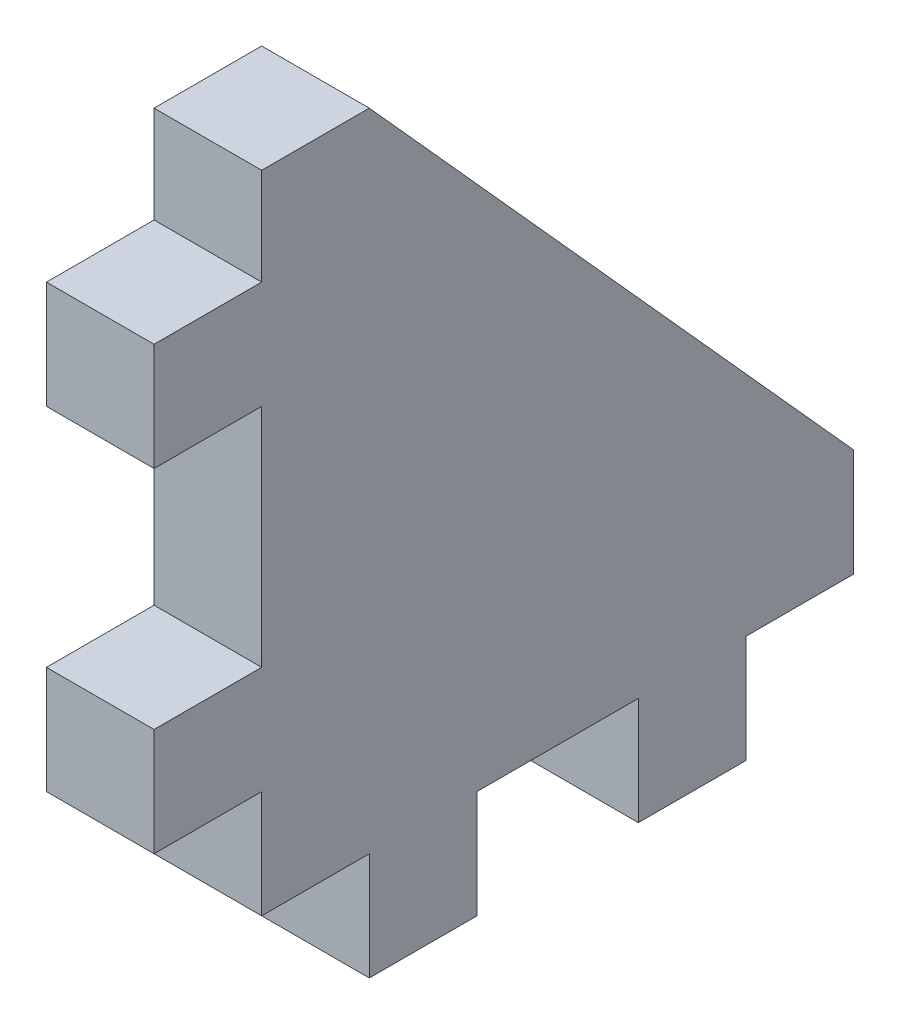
ISO-10303-21;
HEADER;
FILE_DESCRIPTION(('STEP AP214'),'2;1');
FILE_NAME('part.step','',(''),(''),'','','');
FILE_SCHEMA(('AUTOMOTIVE_DESIGN { 1 0 10303 214 1 1 1 1 }'));
ENDSEC;
DATA;
#1=APPLICATION_CONTEXT('core data for automotive mechanical design processes');
#2=APPLICATION_PROTOCOL_DEFINITION('international standard','automotive_design',2000,#1);
#3=PRODUCT_CONTEXT('',#1,'mechanical');
#4=PRODUCT('Part','Part','',(#3));
#5=PRODUCT_RELATED_PRODUCT_CATEGORY('part','',(#4));
#6=PRODUCT_DEFINITION_FORMATION('','',#4);
#7=PRODUCT_DEFINITION_CONTEXT('part definition',#1,'design');
#8=PRODUCT_DEFINITION('design','',#6,#7);
#9=PRODUCT_DEFINITION_SHAPE('','',#8);
#10=(LENGTH_UNIT() NAMED_UNIT(*) SI_UNIT(.MILLI.,.METRE.));
#11=(NAMED_UNIT(*) PLANE_ANGLE_UNIT() SI_UNIT($,.RADIAN.));
#12=(NAMED_UNIT(*) SI_UNIT($,.STERADIAN.) SOLID_ANGLE_UNIT());
#13=UNCERTAINTY_MEASURE_WITH_UNIT(LENGTH_MEASURE(1.E-05),#10,'distance_accuracy_value','');
#14=(GEOMETRIC_REPRESENTATION_CONTEXT(3) GLOBAL_UNCERTAINTY_ASSIGNED_CONTEXT((#13)) GLOBAL_UNIT_ASSIGNED_CONTEXT((#10,
#11,#12)) REPRESENTATION_CONTEXT('',''));
#15=CARTESIAN_POINT('',(0.,0.,0.));
#16=DIRECTION('',(0.,0.,1.));
#17=DIRECTION('',(1.,0.,0.));
#18=AXIS2_PLACEMENT_3D('',#15,#16,#17);
#19=CARTESIAN_POINT('',(20.,40.,20.));
#20=DIRECTION('',(0.,-1.,0.));
#21=DIRECTION('',(0.,0.,-1.));
#22=AXIS2_PLACEMENT_3D('',#19,#20,#21);
#23=PLANE('',#22);
#24=DIRECTION('',(0.,0.,1.));
#25=VECTOR('',#24,1.);
#26=CARTESIAN_POINT('',(0.,40.,20.));
#27=LINE('',#26,#25);
#28=CARTESIAN_POINT('',(0.,40.,0.));
#29=VERTEX_POINT('',#28);
#30=CARTESIAN_POINT('',(0.,40.,20.));
#31=VERTEX_POINT('',#30);
#32=EDGE_CURVE('E206',#29,#31,#27,.T.);
#33=ORIENTED_EDGE('',*,*,#32,.T.);
#34=DIRECTION('',(-1.,0.,0.));
#35=VECTOR('',#34,1.);
#36=CARTESIAN_POINT('',(20.,40.,20.));
#37=LINE('',#36,#35);
#38=CARTESIAN_POINT('',(20.,40.,20.));
#39=VERTEX_POINT('',#38);
#40=EDGE_CURVE('E11',#39,#31,#37,.T.);
#41=ORIENTED_EDGE('',*,*,#40,.F.);
#42=DIRECTION('',(0.,0.,1.));
#43=VECTOR('',#42,1.);
#44=CARTESIAN_POINT('',(20.,40.,20.));
#45=LINE('',#44,#43);
#46=CARTESIAN_POINT('',(20.,40.,0.));
#47=VERTEX_POINT('',#46);
#48=EDGE_CURVE('E246',#47,#39,#45,.T.);
#49=ORIENTED_EDGE('',*,*,#48,.F.);
#50=DIRECTION('',(-1.,0.,0.));
#51=VECTOR('',#50,1.);
#52=CARTESIAN_POINT('',(20.,40.,0.));
#53=LINE('',#52,#51);
#54=EDGE_CURVE('E202',#47,#29,#53,.T.);
#55=ORIENTED_EDGE('',*,*,#54,.T.);
#56=EDGE_LOOP('',(#33,#41,#49,#55));
#57=FACE_BOUND('',#56,.T.);
#58=ADVANCED_FACE('F32',(#57),#23,.F.);
#59=CARTESIAN_POINT('',(20.,20.,20.));
#60=DIRECTION('',(0.,0.,-1.));
#61=DIRECTION('',(-1.,0.,0.));
#62=AXIS2_PLACEMENT_3D('',#59,#60,#61);
#63=PLANE('',#62);
#64=DIRECTION('',(0.,-1.,0.));
#65=VECTOR('',#64,1.);
#66=CARTESIAN_POINT('',(0.,20.,20.));
#67=LINE('',#66,#65);
#68=CARTESIAN_POINT('',(0.,20.,20.));
#69=VERTEX_POINT('',#68);
#70=EDGE_CURVE('E209',#31,#69,#67,.T.);
#71=ORIENTED_EDGE('',*,*,#70,.T.);
#72=DIRECTION('',(-1.,0.,0.));
#73=VECTOR('',#72,1.);
#74=CARTESIAN_POINT('',(20.,20.,20.));
#75=LINE('',#74,#73);
#76=CARTESIAN_POINT('',(20.,20.,20.));
#77=VERTEX_POINT('',#76);
#78=EDGE_CURVE('E40',#77,#69,#75,.T.);
#79=ORIENTED_EDGE('',*,*,#78,.F.);
#80=DIRECTION('',(0.,-1.,0.));
#81=VECTOR('',#80,1.);
#82=CARTESIAN_POINT('',(20.,20.,20.));
#83=LINE('',#82,#81);
#84=EDGE_CURVE('E130',#39,#77,#83,.T.);
#85=ORIENTED_EDGE('',*,*,#84,.F.);
#86=ORIENTED_EDGE('',*,*,#40,.T.);
#87=EDGE_LOOP('',(#71,#79,#85,#86));
#88=FACE_BOUND('',#87,.T.);
#89=ADVANCED_FACE('F369',(#88),#63,.F.);
#90=CARTESIAN_POINT('',(20.,20.,0.));
#91=DIRECTION('',(0.,1.,0.));
#92=DIRECTION('',(0.,0.,1.));
#93=AXIS2_PLACEMENT_3D('',#90,#91,#92);
#94=PLANE('',#93);
#95=DIRECTION('',(0.,0.,-1.));
#96=VECTOR('',#95,1.);
#97=CARTESIAN_POINT('',(0.,20.,0.));
#98=LINE('',#97,#96);
#99=CARTESIAN_POINT('',(0.,20.,0.));
#100=VERTEX_POINT('',#99);
#101=EDGE_CURVE('E211',#69,#100,#98,.T.);
#102=ORIENTED_EDGE('',*,*,#101,.T.);
#103=DIRECTION('',(-1.,0.,0.));
#104=VECTOR('',#103,1.);
#105=CARTESIAN_POINT('',(20.,20.,0.));
#106=LINE('',#105,#104);
#107=CARTESIAN_POINT('',(20.,20.,0.));
#108=VERTEX_POINT('',#107);
#109=EDGE_CURVE('E292',#108,#100,#106,.T.);
#110=ORIENTED_EDGE('',*,*,#109,.F.);
#111=DIRECTION('',(0.,0.,-1.));
#112=VECTOR('',#111,1.);
#113=CARTESIAN_POINT('',(20.,20.,0.));
#114=LINE('',#113,#112);
#115=EDGE_CURVE('E300',#77,#108,#114,.T.);
#116=ORIENTED_EDGE('',*,*,#115,.F.);
#117=ORIENTED_EDGE('',*,*,#78,.T.);
#118=EDGE_LOOP('',(#102,#110,#116,#117));
#119=FACE_BOUND('',#118,.T.);
#120=ADVANCED_FACE('F298',(#119),#94,.F.);
#121=CARTESIAN_POINT('',(20.,0.,0.));
#122=DIRECTION('',(0.,0.,-1.));
#123=DIRECTION('',(-1.,0.,0.));
#124=AXIS2_PLACEMENT_3D('',#121,#122,#123);
#125=PLANE('',#124);
#126=DIRECTION('',(0.,-1.,0.));
#127=VECTOR('',#126,1.);
#128=CARTESIAN_POINT('',(0.,0.,0.));
#129=LINE('',#128,#127);
#130=CARTESIAN_POINT('',(0.,0.,0.));
#131=VERTEX_POINT('',#130);
#132=EDGE_CURVE('E213',#100,#131,#129,.T.);
#133=ORIENTED_EDGE('',*,*,#132,.T.);
#134=DIRECTION('',(-1.,0.,0.));
#135=VECTOR('',#134,1.);
#136=CARTESIAN_POINT('',(20.,0.,0.));
#137=LINE('',#136,#135);
#138=CARTESIAN_POINT('',(20.,0.,0.));
#139=VERTEX_POINT('',#138);
#140=EDGE_CURVE('E289',#139,#131,#137,.T.);
#141=ORIENTED_EDGE('',*,*,#140,.F.);
#142=DIRECTION('',(0.,-1.,0.));
#143=VECTOR('',#142,1.);
#144=CARTESIAN_POINT('',(20.,0.,0.));
#145=LINE('',#144,#143);
#146=EDGE_CURVE('E318',#108,#139,#145,.T.);
#147=ORIENTED_EDGE('',*,*,#146,.F.);
#148=ORIENTED_EDGE('',*,*,#109,.T.);
#149=EDGE_LOOP('',(#133,#141,#147,#148));
#150=FACE_BOUND('',#149,.T.);
#151=ADVANCED_FACE('F309',(#150),#125,.F.);
#152=CARTESIAN_POINT('',(20.,0.,0.));
#153=DIRECTION('',(0.,1.,0.));
#154=DIRECTION('',(0.,0.,1.));
#155=AXIS2_PLACEMENT_3D('',#152,#153,#154);
#156=PLANE('',#155);
#157=DIRECTION('',(0.,0.,-1.));
#158=VECTOR('',#157,1.);
#159=CARTESIAN_POINT('',(0.,0.,0.));
#160=LINE('',#159,#158);
#161=CARTESIAN_POINT('',(0.,0.,-20.));
#162=VERTEX_POINT('',#161);
#163=EDGE_CURVE('E215',#131,#162,#160,.T.);
#164=ORIENTED_EDGE('',*,*,#163,.T.);
#165=DIRECTION('',(-1.,0.,0.));
#166=VECTOR('',#165,1.);
#167=CARTESIAN_POINT('',(20.,0.,-20.));
#168=LINE('',#167,#166);
#169=CARTESIAN_POINT('',(20.,0.,-20.));
#170=VERTEX_POINT('',#169);
#171=EDGE_CURVE('E286',#170,#162,#168,.T.);
#172=ORIENTED_EDGE('',*,*,#171,.F.);
#173=DIRECTION('',(0.,0.,-1.));
#174=VECTOR('',#173,1.);
#175=CARTESIAN_POINT('',(20.,0.,0.));
#176=LINE('',#175,#174);
#177=EDGE_CURVE('E315',#139,#170,#176,.T.);
#178=ORIENTED_EDGE('',*,*,#177,.F.);
#179=ORIENTED_EDGE('',*,*,#140,.T.);
#180=EDGE_LOOP('',(#164,#172,#178,#179));
#181=FACE_BOUND('',#180,.T.);
#182=ADVANCED_FACE('F313',(#181),#156,.F.);
#183=CARTESIAN_POINT('',(20.,0.,-20.));
#184=DIRECTION('',(0.,0.,-1.));
#185=DIRECTION('',(-1.,0.,0.));
#186=AXIS2_PLACEMENT_3D('',#183,#184,#185);
#187=PLANE('',#186);
#188=DIRECTION('',(0.,-1.,0.));
#189=VECTOR('',#188,1.);
#190=CARTESIAN_POINT('',(0.,0.,-20.));
#191=LINE('',#190,#189);
#192=CARTESIAN_POINT('',(0.,-20.,-20.));
#193=VERTEX_POINT('',#192);
#194=EDGE_CURVE('E217',#162,#193,#191,.T.);
#195=ORIENTED_EDGE('',*,*,#194,.T.);
#196=DIRECTION('',(-1.,0.,0.));
#197=VECTOR('',#196,1.);
#198=CARTESIAN_POINT('',(20.,-20.,-20.));
#199=LINE('',#198,#197);
#200=CARTESIAN_POINT('',(20.,-20.,-20.));
#201=VERTEX_POINT('',#200);
#202=EDGE_CURVE('E283',#201,#193,#199,.T.);
#203=ORIENTED_EDGE('',*,*,#202,.F.);
#204=DIRECTION('',(0.,-1.,0.));
#205=VECTOR('',#204,1.);
#206=CARTESIAN_POINT('',(20.,0.,-20.));
#207=LINE('',#206,#205);
#208=EDGE_CURVE('E317',#170,#201,#207,.T.);
#209=ORIENTED_EDGE('',*,*,#208,.F.);
#210=ORIENTED_EDGE('',*,*,#171,.T.);
#211=EDGE_LOOP('',(#195,#203,#209,#210));
#212=FACE_BOUND('',#211,.T.);
#213=ADVANCED_FACE('F382',(#212),#187,.F.);
#214=CARTESIAN_POINT('',(20.,-20.,-20.));
#215=DIRECTION('',(0.,1.,0.));
#216=DIRECTION('',(0.,0.,1.));
#217=AXIS2_PLACEMENT_3D('',#214,#215,#216);
#218=PLANE('',#217);
#219=DIRECTION('',(0.,0.,-1.));
#220=VECTOR('',#219,1.);
#221=CARTESIAN_POINT('',(0.,-20.,-20.));
#222=LINE('',#221,#220);
#223=CARTESIAN_POINT('',(0.,-20.,-40.));
#224=VERTEX_POINT('',#223);
#225=EDGE_CURVE('E219',#193,#224,#222,.T.);
#226=ORIENTED_EDGE('',*,*,#225,.T.);
#227=DIRECTION('',(-1.,0.,0.));
#228=VECTOR('',#227,1.);
#229=CARTESIAN_POINT('',(20.,-20.,-40.));
#230=LINE('',#229,#228);
#231=CARTESIAN_POINT('',(20.,-20.,-40.));
#232=VERTEX_POINT('',#231);
#233=EDGE_CURVE('E280',#232,#224,#230,.T.);
#234=ORIENTED_EDGE('',*,*,#233,.F.);
#235=DIRECTION('',(0.,0.,-1.));
#236=VECTOR('',#235,1.);
#237=CARTESIAN_POINT('',(20.,-20.,-20.));
#238=LINE('',#237,#236);
#239=EDGE_CURVE('E320',#201,#232,#238,.T.);
#240=ORIENTED_EDGE('',*,*,#239,.F.);
#241=ORIENTED_EDGE('',*,*,#202,.T.);
#242=EDGE_LOOP('',(#226,#234,#240,#241));
#243=FACE_BOUND('',#242,.T.);
#244=ADVANCED_FACE('F385',(#243),#218,.F.);
#245=CARTESIAN_POINT('',(20.,-20.,-40.));
#246=DIRECTION('',(0.,0.,1.));
#247=DIRECTION('',(1.,0.,0.));
#248=AXIS2_PLACEMENT_3D('',#245,#246,#247);
#249=PLANE('',#248);
#250=DIRECTION('',(0.,1.,0.));
#251=VECTOR('',#250,1.);
#252=CARTESIAN_POINT('',(0.,-20.,-40.));
#253=LINE('',#252,#251);
#254=CARTESIAN_POINT('',(0.,0.,-40.));
#255=VERTEX_POINT('',#254);
#256=EDGE_CURVE('E221',#224,#255,#253,.T.);
#257=ORIENTED_EDGE('',*,*,#256,.T.);
#258=DIRECTION('',(-1.,0.,0.));
#259=VECTOR('',#258,1.);
#260=CARTESIAN_POINT('',(20.,0.,-40.));
#261=LINE('',#260,#259);
#262=CARTESIAN_POINT('',(20.,0.,-40.));
#263=VERTEX_POINT('',#262);
#264=EDGE_CURVE('E277',#263,#255,#261,.T.);
#265=ORIENTED_EDGE('',*,*,#264,.F.);
#266=DIRECTION('',(0.,1.,0.));
#267=VECTOR('',#266,1.);
#268=CARTESIAN_POINT('',(20.,-20.,-40.));
#269=LINE('',#268,#267);
#270=EDGE_CURVE('E326',#232,#263,#269,.T.);
#271=ORIENTED_EDGE('',*,*,#270,.F.);
#272=ORIENTED_EDGE('',*,*,#233,.T.);
#273=EDGE_LOOP('',(#257,#265,#271,#272));
#274=FACE_BOUND('',#273,.T.);
#275=ADVANCED_FACE('F389',(#274),#249,.F.);
#276=CARTESIAN_POINT('',(20.,0.,-40.));
#277=DIRECTION('',(0.,1.,0.));
#278=DIRECTION('',(0.,0.,1.));
#279=AXIS2_PLACEMENT_3D('',#276,#277,#278);
#280=PLANE('',#279);
#281=DIRECTION('',(0.,0.,-1.));
#282=VECTOR('',#281,1.);
#283=CARTESIAN_POINT('',(0.,0.,-40.));
#284=LINE('',#283,#282);
#285=CARTESIAN_POINT('',(0.,0.,-70.));
#286=VERTEX_POINT('',#285);
#287=EDGE_CURVE('E223',#255,#286,#284,.T.);
#288=ORIENTED_EDGE('',*,*,#287,.T.);
#289=DIRECTION('',(-1.,0.,0.));
#290=VECTOR('',#289,1.);
#291=CARTESIAN_POINT('',(20.,0.,-70.));
#292=LINE('',#291,#290);
#293=CARTESIAN_POINT('',(20.,0.,-70.));
#294=VERTEX_POINT('',#293);
#295=EDGE_CURVE('E274',#294,#286,#292,.T.);
#296=ORIENTED_EDGE('',*,*,#295,.F.);
#297=DIRECTION('',(0.,0.,-1.));
#298=VECTOR('',#297,1.);
#299=CARTESIAN_POINT('',(20.,0.,-40.));
#300=LINE('',#299,#298);
#301=EDGE_CURVE('E328',#263,#294,#300,.T.);
#302=ORIENTED_EDGE('',*,*,#301,.F.);
#303=ORIENTED_EDGE('',*,*,#264,.T.);
#304=EDGE_LOOP('',(#288,#296,#302,#303));
#305=FACE_BOUND('',#304,.T.);
#306=ADVANCED_FACE('F393',(#305),#280,.F.);
#307=CARTESIAN_POINT('',(20.,-20.,-70.));
#308=DIRECTION('',(0.,0.,-1.));
#309=DIRECTION('',(-1.,0.,0.));
#310=AXIS2_PLACEMENT_3D('',#307,#308,#309);
#311=PLANE('',#310);
#312=DIRECTION('',(0.,-1.,0.));
#313=VECTOR('',#312,1.);
#314=CARTESIAN_POINT('',(0.,-20.,-70.));
#315=LINE('',#314,#313);
#316=CARTESIAN_POINT('',(0.,-20.,-70.));
#317=VERTEX_POINT('',#316);
#318=EDGE_CURVE('E225',#286,#317,#315,.T.);
#319=ORIENTED_EDGE('',*,*,#318,.T.);
#320=DIRECTION('',(-1.,0.,0.));
#321=VECTOR('',#320,1.);
#322=CARTESIAN_POINT('',(20.,-20.,-70.));
#323=LINE('',#322,#321);
#324=CARTESIAN_POINT('',(20.,-20.,-70.));
#325=VERTEX_POINT('',#324);
#326=EDGE_CURVE('E271',#325,#317,#323,.T.);
#327=ORIENTED_EDGE('',*,*,#326,.F.);
#328=DIRECTION('',(0.,-1.,0.));
#329=VECTOR('',#328,1.);
#330=CARTESIAN_POINT('',(20.,-20.,-70.));
#331=LINE('',#330,#329);
#332=EDGE_CURVE('E330',#294,#325,#331,.T.);
#333=ORIENTED_EDGE('',*,*,#332,.F.);
#334=ORIENTED_EDGE('',*,*,#295,.T.);
#335=EDGE_LOOP('',(#319,#327,#333,#334));
#336=FACE_BOUND('',#335,.T.);
#337=ADVANCED_FACE('F397',(#336),#311,.F.);
#338=CARTESIAN_POINT('',(20.,-20.,-90.));
#339=DIRECTION('',(0.,1.,0.));
#340=DIRECTION('',(0.,0.,1.));
#341=AXIS2_PLACEMENT_3D('',#338,#339,#340);
#342=PLANE('',#341);
#343=DIRECTION('',(0.,0.,-1.));
#344=VECTOR('',#343,1.);
#345=CARTESIAN_POINT('',(0.,-20.,-90.));
#346=LINE('',#345,#344);
#347=CARTESIAN_POINT('',(0.,-20.,-90.));
#348=VERTEX_POINT('',#347);
#349=EDGE_CURVE('E227',#317,#348,#346,.T.);
#350=ORIENTED_EDGE('',*,*,#349,.T.);
#351=DIRECTION('',(-1.,0.,0.));
#352=VECTOR('',#351,1.);
#353=CARTESIAN_POINT('',(20.,-20.,-90.));
#354=LINE('',#353,#352);
#355=CARTESIAN_POINT('',(20.,-20.,-90.));
#356=VERTEX_POINT('',#355);
#357=EDGE_CURVE('E268',#356,#348,#354,.T.);
#358=ORIENTED_EDGE('',*,*,#357,.F.);
#359=DIRECTION('',(0.,0.,-1.));
#360=VECTOR('',#359,1.);
#361=CARTESIAN_POINT('',(20.,-20.,-90.));
#362=LINE('',#361,#360);
#363=EDGE_CURVE('E332',#325,#356,#362,.T.);
#364=ORIENTED_EDGE('',*,*,#363,.F.);
#365=ORIENTED_EDGE('',*,*,#326,.T.);
#366=EDGE_LOOP('',(#350,#358,#364,#365));
#367=FACE_BOUND('',#366,.T.);
#368=ADVANCED_FACE('F401',(#367),#342,.F.);
#369=CARTESIAN_POINT('',(20.,0.,-90.));
#370=DIRECTION('',(0.,0.,1.));
#371=DIRECTION('',(1.,0.,0.));
#372=AXIS2_PLACEMENT_3D('',#369,#370,#371);
#373=PLANE('',#372);
#374=DIRECTION('',(0.,1.,0.));
#375=VECTOR('',#374,1.);
#376=CARTESIAN_POINT('',(0.,0.,-90.));
#377=LINE('',#376,#375);
#378=CARTESIAN_POINT('',(0.,0.,-90.));
#379=VERTEX_POINT('',#378);
#380=EDGE_CURVE('E229',#348,#379,#377,.T.);
#381=ORIENTED_EDGE('',*,*,#380,.T.);
#382=DIRECTION('',(-1.,0.,0.));
#383=VECTOR('',#382,1.);
#384=CARTESIAN_POINT('',(20.,0.,-90.));
#385=LINE('',#384,#383);
#386=CARTESIAN_POINT('',(20.,0.,-90.));
#387=VERTEX_POINT('',#386);
#388=EDGE_CURVE('E265',#387,#379,#385,.T.);
#389=ORIENTED_EDGE('',*,*,#388,.F.);
#390=DIRECTION('',(0.,1.,0.));
#391=VECTOR('',#390,1.);
#392=CARTESIAN_POINT('',(20.,0.,-90.));
#393=LINE('',#392,#391);
#394=EDGE_CURVE('E334',#356,#387,#393,.T.);
#395=ORIENTED_EDGE('',*,*,#394,.F.);
#396=ORIENTED_EDGE('',*,*,#357,.T.);
#397=EDGE_LOOP('',(#381,#389,#395,#396));
#398=FACE_BOUND('',#397,.T.);
#399=ADVANCED_FACE('F405',(#398),#373,.F.);
#400=CARTESIAN_POINT('',(20.,0.,-90.));
#401=DIRECTION('',(0.,1.,0.));
#402=DIRECTION('',(0.,0.,1.));
#403=AXIS2_PLACEMENT_3D('',#400,#401,#402);
#404=PLANE('',#403);
#405=DIRECTION('',(0.,0.,-1.));
#406=VECTOR('',#405,1.);
#407=CARTESIAN_POINT('',(0.,0.,-90.));
#408=LINE('',#407,#406);
#409=CARTESIAN_POINT('',(0.,0.,-110.));
#410=VERTEX_POINT('',#409);
#411=EDGE_CURVE('E231',#379,#410,#408,.T.);
#412=ORIENTED_EDGE('',*,*,#411,.T.);
#413=DIRECTION('',(-1.,0.,0.));
#414=VECTOR('',#413,1.);
#415=CARTESIAN_POINT('',(20.,0.,-110.));
#416=LINE('',#415,#414);
#417=CARTESIAN_POINT('',(20.,0.,-110.));
#418=VERTEX_POINT('',#417);
#419=EDGE_CURVE('E262',#418,#410,#416,.T.);
#420=ORIENTED_EDGE('',*,*,#419,.F.);
#421=DIRECTION('',(0.,0.,-1.));
#422=VECTOR('',#421,1.);
#423=CARTESIAN_POINT('',(20.,0.,-90.));
#424=LINE('',#423,#422);
#425=EDGE_CURVE('E336',#387,#418,#424,.T.);
#426=ORIENTED_EDGE('',*,*,#425,.F.);
#427=ORIENTED_EDGE('',*,*,#388,.T.);
#428=EDGE_LOOP('',(#412,#420,#426,#427));
#429=FACE_BOUND('',#428,.T.);
#430=ADVANCED_FACE('F409',(#429),#404,.F.);
#431=CARTESIAN_POINT('',(20.,0.,-110.));
#432=DIRECTION('',(0.,0.,1.));
#433=DIRECTION('',(1.,0.,0.));
#434=AXIS2_PLACEMENT_3D('',#431,#432,#433);
#435=PLANE('',#434);
#436=DIRECTION('',(0.,1.,0.));
#437=VECTOR('',#436,1.);
#438=CARTESIAN_POINT('',(0.,0.,-110.));
#439=LINE('',#438,#437);
#440=CARTESIAN_POINT('',(0.,20.,-110.));
#441=VERTEX_POINT('',#440);
#442=EDGE_CURVE('E233',#410,#441,#439,.T.);
#443=ORIENTED_EDGE('',*,*,#442,.T.);
#444=DIRECTION('',(-1.,0.,0.));
#445=VECTOR('',#444,1.);
#446=CARTESIAN_POINT('',(20.,20.,-110.));
#447=LINE('',#446,#445);
#448=CARTESIAN_POINT('',(20.,20.,-110.));
#449=VERTEX_POINT('',#448);
#450=EDGE_CURVE('E259',#449,#441,#447,.T.);
#451=ORIENTED_EDGE('',*,*,#450,.F.);
#452=DIRECTION('',(0.,1.,0.));
#453=VECTOR('',#452,1.);
#454=CARTESIAN_POINT('',(20.,0.,-110.));
#455=LINE('',#454,#453);
#456=EDGE_CURVE('E338',#418,#449,#455,.T.);
#457=ORIENTED_EDGE('',*,*,#456,.F.);
#458=ORIENTED_EDGE('',*,*,#419,.T.);
#459=EDGE_LOOP('',(#443,#451,#457,#458));
#460=FACE_BOUND('',#459,.T.);
#461=ADVANCED_FACE('F413',(#460),#435,.F.);
#462=CARTESIAN_POINT('',(20.,20.,-110.));
#463=DIRECTION('',(0.,-0.66896473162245,0.743294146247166));
#464=DIRECTION('',(0.,-0.743294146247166,-0.66896473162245));
#465=AXIS2_PLACEMENT_3D('',#462,#463,#464);
#466=PLANE('',#465);
#467=DIRECTION('',(0.,0.743294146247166,0.66896473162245));
#468=VECTOR('',#467,1.);
#469=CARTESIAN_POINT('',(0.,20.,-110.));
#470=LINE('',#469,#468);
#471=CARTESIAN_POINT('',(0.,120.,-20.));
#472=VERTEX_POINT('',#471);
#473=EDGE_CURVE('E235',#441,#472,#470,.T.);
#474=ORIENTED_EDGE('',*,*,#473,.T.);
#475=DIRECTION('',(-1.,0.,0.));
#476=VECTOR('',#475,1.);
#477=CARTESIAN_POINT('',(20.,120.,-20.));
#478=LINE('',#477,#476);
#479=CARTESIAN_POINT('',(20.,120.,-20.));
#480=VERTEX_POINT('',#479);
#481=EDGE_CURVE('E256',#480,#472,#478,.T.);
#482=ORIENTED_EDGE('',*,*,#481,.F.);
#483=DIRECTION('',(0.,0.743294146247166,0.66896473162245));
#484=VECTOR('',#483,1.);
#485=CARTESIAN_POINT('',(20.,20.,-110.));
#486=LINE('',#485,#484);
#487=EDGE_CURVE('E340',#449,#480,#486,.T.);
#488=ORIENTED_EDGE('',*,*,#487,.F.);
#489=ORIENTED_EDGE('',*,*,#450,.T.);
#490=EDGE_LOOP('',(#474,#482,#488,#489));
#491=FACE_BOUND('',#490,.T.);
#492=ADVANCED_FACE('F417',(#491),#466,.F.);
#493=CARTESIAN_POINT('',(20.,120.,0.));
#494=DIRECTION('',(0.,-1.,0.));
#495=DIRECTION('',(0.,0.,-1.));
#496=AXIS2_PLACEMENT_3D('',#493,#494,#495);
#497=PLANE('',#496);
#498=DIRECTION('',(0.,0.,1.));
#499=VECTOR('',#498,1.);
#500=CARTESIAN_POINT('',(0.,120.,0.));
#501=LINE('',#500,#499);
#502=CARTESIAN_POINT('',(0.,120.,0.));
#503=VERTEX_POINT('',#502);
#504=EDGE_CURVE('E237',#472,#503,#501,.T.);
#505=ORIENTED_EDGE('',*,*,#504,.T.);
#506=DIRECTION('',(-1.,0.,0.));
#507=VECTOR('',#506,1.);
#508=CARTESIAN_POINT('',(20.,120.,0.));
#509=LINE('',#508,#507);
#510=CARTESIAN_POINT('',(20.,120.,0.));
#511=VERTEX_POINT('',#510);
#512=EDGE_CURVE('E253',#511,#503,#509,.T.);
#513=ORIENTED_EDGE('',*,*,#512,.F.);
#514=DIRECTION('',(0.,0.,1.));
#515=VECTOR('',#514,1.);
#516=CARTESIAN_POINT('',(20.,120.,0.));
#517=LINE('',#516,#515);
#518=EDGE_CURVE('E342',#480,#511,#517,.T.);
#519=ORIENTED_EDGE('',*,*,#518,.F.);
#520=ORIENTED_EDGE('',*,*,#481,.T.);
#521=EDGE_LOOP('',(#505,#513,#519,#520));
#522=FACE_BOUND('',#521,.T.);
#523=ADVANCED_FACE('F421',(#522),#497,.F.);
#524=CARTESIAN_POINT('',(20.,102.,0.));
#525=DIRECTION('',(0.,0.,-1.));
#526=DIRECTION('',(0.,1.,0.));
#527=AXIS2_PLACEMENT_3D('',#524,#525,#526);
#528=PLANE('',#527);
#529=DIRECTION('',(0.,-1.,0.));
#530=VECTOR('',#529,1.);
#531=CARTESIAN_POINT('',(0.,102.,0.));
#532=LINE('',#531,#530);
#533=CARTESIAN_POINT('',(0.,102.,0.));
#534=VERTEX_POINT('',#533);
#535=EDGE_CURVE('E239',#503,#534,#532,.T.);
#536=ORIENTED_EDGE('',*,*,#535,.T.);
#537=DIRECTION('',(-1.,0.,0.));
#538=VECTOR('',#537,1.);
#539=CARTESIAN_POINT('',(20.,102.,0.));
#540=LINE('',#539,#538);
#541=CARTESIAN_POINT('',(20.,102.,0.));
#542=VERTEX_POINT('',#541);
#543=EDGE_CURVE('E250',#542,#534,#540,.T.);
#544=ORIENTED_EDGE('',*,*,#543,.F.);
#545=DIRECTION('',(0.,-1.,0.));
#546=VECTOR('',#545,1.);
#547=CARTESIAN_POINT('',(20.,102.,0.));
#548=LINE('',#547,#546);
#549=EDGE_CURVE('E344',#511,#542,#548,.T.);
#550=ORIENTED_EDGE('',*,*,#549,.F.);
#551=ORIENTED_EDGE('',*,*,#512,.T.);
#552=EDGE_LOOP('',(#536,#544,#550,#551));
#553=FACE_BOUND('',#552,.T.);
#554=ADVANCED_FACE('F350',(#553),#528,.F.);
#555=CARTESIAN_POINT('',(20.,102.,0.));
#556=DIRECTION('',(0.,-1.,0.));
#557=DIRECTION('',(0.,0.,-1.));
#558=AXIS2_PLACEMENT_3D('',#555,#556,#557);
#559=PLANE('',#558);
#560=DIRECTION('',(0.,0.,1.));
#561=VECTOR('',#560,1.);
#562=CARTESIAN_POINT('',(0.,102.,0.));
#563=LINE('',#562,#561);
#564=CARTESIAN_POINT('',(0.,102.,20.));
#565=VERTEX_POINT('',#564);
#566=EDGE_CURVE('E241',#534,#565,#563,.T.);
#567=ORIENTED_EDGE('',*,*,#566,.T.);
#568=DIRECTION('',(-1.,0.,0.));
#569=VECTOR('',#568,1.);
#570=CARTESIAN_POINT('',(20.,102.,20.));
#571=LINE('',#570,#569);
#572=CARTESIAN_POINT('',(20.,102.,20.));
#573=VERTEX_POINT('',#572);
#574=EDGE_CURVE('E197',#573,#565,#571,.T.);
#575=ORIENTED_EDGE('',*,*,#574,.F.);
#576=DIRECTION('',(0.,0.,1.));
#577=VECTOR('',#576,1.);
#578=CARTESIAN_POINT('',(20.,102.,0.));
#579=LINE('',#578,#577);
#580=EDGE_CURVE('E188',#542,#573,#579,.T.);
#581=ORIENTED_EDGE('',*,*,#580,.F.);
#582=ORIENTED_EDGE('',*,*,#543,.T.);
#583=EDGE_LOOP('',(#567,#575,#581,#582));
#584=FACE_BOUND('',#583,.T.);
#585=ADVANCED_FACE('F354',(#584),#559,.F.);
#586=CARTESIAN_POINT('',(20.,102.,20.));
#587=DIRECTION('',(0.,0.,-1.));
#588=DIRECTION('',(0.,1.,0.));
#589=AXIS2_PLACEMENT_3D('',#586,#587,#588);
#590=PLANE('',#589);
#591=DIRECTION('',(0.,-1.,0.));
#592=VECTOR('',#591,1.);
#593=CARTESIAN_POINT('',(0.,102.,20.));
#594=LINE('',#593,#592);
#595=CARTESIAN_POINT('',(0.,82.,20.));
#596=VERTEX_POINT('',#595);
#597=EDGE_CURVE('E196',#565,#596,#594,.T.);
#598=ORIENTED_EDGE('',*,*,#597,.T.);
#599=DIRECTION('',(-1.,0.,0.));
#600=VECTOR('',#599,1.);
#601=CARTESIAN_POINT('',(20.,82.,20.));
#602=LINE('',#601,#600);
#603=CARTESIAN_POINT('',(20.,82.,20.));
#604=VERTEX_POINT('',#603);
#605=EDGE_CURVE('E193',#604,#596,#602,.T.);
#606=ORIENTED_EDGE('',*,*,#605,.F.);
#607=DIRECTION('',(0.,-1.,0.));
#608=VECTOR('',#607,1.);
#609=CARTESIAN_POINT('',(20.,102.,20.));
#610=LINE('',#609,#608);
#611=EDGE_CURVE('E182',#573,#604,#610,.T.);
#612=ORIENTED_EDGE('',*,*,#611,.F.);
#613=ORIENTED_EDGE('',*,*,#574,.T.);
#614=EDGE_LOOP('',(#598,#606,#612,#613));
#615=FACE_BOUND('',#614,.T.);
#616=ADVANCED_FACE('F194',(#615),#590,.F.);
#617=CARTESIAN_POINT('',(20.,82.,20.));
#618=DIRECTION('',(0.,1.,0.));
#619=DIRECTION('',(0.,0.,1.));
#620=AXIS2_PLACEMENT_3D('',#617,#618,#619);
#621=PLANE('',#620);
#622=DIRECTION('',(0.,0.,-1.));
#623=VECTOR('',#622,1.);
#624=CARTESIAN_POINT('',(0.,82.,20.));
#625=LINE('',#624,#623);
#626=CARTESIAN_POINT('',(0.,82.,0.));
#627=VERTEX_POINT('',#626);
#628=EDGE_CURVE('E116',#596,#627,#625,.T.);
#629=ORIENTED_EDGE('',*,*,#628,.T.);
#630=DIRECTION('',(-1.,0.,0.));
#631=VECTOR('',#630,1.);
#632=CARTESIAN_POINT('',(20.,82.,0.));
#633=LINE('',#632,#631);
#634=CARTESIAN_POINT('',(20.,82.,0.));
#635=VERTEX_POINT('',#634);
#636=EDGE_CURVE('E198',#635,#627,#633,.T.);
#637=ORIENTED_EDGE('',*,*,#636,.F.);
#638=DIRECTION('',(0.,0.,-1.));
#639=VECTOR('',#638,1.);
#640=CARTESIAN_POINT('',(20.,82.,20.));
#641=LINE('',#640,#639);
#642=EDGE_CURVE('E186',#604,#635,#641,.T.);
#643=ORIENTED_EDGE('',*,*,#642,.F.);
#644=ORIENTED_EDGE('',*,*,#605,.T.);
#645=EDGE_LOOP('',(#629,#637,#643,#644));
#646=FACE_BOUND('',#645,.T.);
#647=ADVANCED_FACE('F200',(#646),#621,.F.);
#648=CARTESIAN_POINT('',(20.,40.,0.));
#649=DIRECTION('',(0.,0.,-1.));
#650=DIRECTION('',(-1.,0.,0.));
#651=AXIS2_PLACEMENT_3D('',#648,#649,#650);
#652=PLANE('',#651);
#653=DIRECTION('',(0.,-1.,0.));
#654=VECTOR('',#653,1.);
#655=CARTESIAN_POINT('',(0.,40.,0.));
#656=LINE('',#655,#654);
#657=EDGE_CURVE('E122',#627,#29,#656,.T.);
#658=ORIENTED_EDGE('',*,*,#657,.T.);
#659=ORIENTED_EDGE('',*,*,#54,.F.);
#660=DIRECTION('',(0.,-1.,0.));
#661=VECTOR('',#660,1.);
#662=CARTESIAN_POINT('',(20.,40.,0.));
#663=LINE('',#662,#661);
#664=EDGE_CURVE('E48',#635,#47,#663,.T.);
#665=ORIENTED_EDGE('',*,*,#664,.F.);
#666=ORIENTED_EDGE('',*,*,#636,.T.);
#667=EDGE_LOOP('',(#658,#659,#665,#666));
#668=FACE_BOUND('',#667,.T.);
#669=ADVANCED_FACE('F358',(#668),#652,.F.);
#670=CARTESIAN_POINT('',(20.,0.,0.));
#671=DIRECTION('',(1.,0.,0.));
#672=DIRECTION('',(0.,0.,-1.));
#673=AXIS2_PLACEMENT_3D('',#670,#671,#672);
#674=PLANE('',#673);
#675=ORIENTED_EDGE('',*,*,#48,.T.);
#676=ORIENTED_EDGE('',*,*,#84,.T.);
#677=ORIENTED_EDGE('',*,*,#115,.T.);
#678=ORIENTED_EDGE('',*,*,#146,.T.);
#679=ORIENTED_EDGE('',*,*,#177,.T.);
#680=ORIENTED_EDGE('',*,*,#208,.T.);
#681=ORIENTED_EDGE('',*,*,#239,.T.);
#682=ORIENTED_EDGE('',*,*,#270,.T.);
#683=ORIENTED_EDGE('',*,*,#301,.T.);
#684=ORIENTED_EDGE('',*,*,#332,.T.);
#685=ORIENTED_EDGE('',*,*,#363,.T.);
#686=ORIENTED_EDGE('',*,*,#394,.T.);
#687=ORIENTED_EDGE('',*,*,#425,.T.);
#688=ORIENTED_EDGE('',*,*,#456,.T.);
#689=ORIENTED_EDGE('',*,*,#487,.T.);
#690=ORIENTED_EDGE('',*,*,#518,.T.);
#691=ORIENTED_EDGE('',*,*,#549,.T.);
#692=ORIENTED_EDGE('',*,*,#580,.T.);
#693=ORIENTED_EDGE('',*,*,#611,.T.);
#694=ORIENTED_EDGE('',*,*,#642,.T.);
#695=ORIENTED_EDGE('',*,*,#664,.T.);
#696=EDGE_LOOP('',(#675,#676,#677,#678,#679,#680,#681,#682,#683,#684,#685,#686,#687,#688,#689,
#690,#691,#692,#693,#694,#695));
#697=FACE_BOUND('',#696,.T.);
#698=ADVANCED_FACE('F184',(#697),#674,.T.);
#699=CARTESIAN_POINT('',(0.,0.,0.));
#700=DIRECTION('',(1.,0.,0.));
#701=DIRECTION('',(0.,0.,-1.));
#702=AXIS2_PLACEMENT_3D('',#699,#700,#701);
#703=PLANE('',#702);
#704=ORIENTED_EDGE('',*,*,#32,.F.);
#705=ORIENTED_EDGE('',*,*,#657,.F.);
#706=ORIENTED_EDGE('',*,*,#628,.F.);
#707=ORIENTED_EDGE('',*,*,#597,.F.);
#708=ORIENTED_EDGE('',*,*,#566,.F.);
#709=ORIENTED_EDGE('',*,*,#535,.F.);
#710=ORIENTED_EDGE('',*,*,#504,.F.);
#711=ORIENTED_EDGE('',*,*,#473,.F.);
#712=ORIENTED_EDGE('',*,*,#442,.F.);
#713=ORIENTED_EDGE('',*,*,#411,.F.);
#714=ORIENTED_EDGE('',*,*,#380,.F.);
#715=ORIENTED_EDGE('',*,*,#349,.F.);
#716=ORIENTED_EDGE('',*,*,#318,.F.);
#717=ORIENTED_EDGE('',*,*,#287,.F.);
#718=ORIENTED_EDGE('',*,*,#256,.F.);
#719=ORIENTED_EDGE('',*,*,#225,.F.);
#720=ORIENTED_EDGE('',*,*,#194,.F.);
#721=ORIENTED_EDGE('',*,*,#163,.F.);
#722=ORIENTED_EDGE('',*,*,#132,.F.);
#723=ORIENTED_EDGE('',*,*,#101,.F.);
#724=ORIENTED_EDGE('',*,*,#70,.F.);
#725=EDGE_LOOP('',(#704,#705,#706,#707,#708,#709,#710,#711,#712,#713,#714,#715,#716,#717,#718,
#719,#720,#721,#722,#723,#724));
#726=FACE_BOUND('',#725,.T.);
#727=ADVANCED_FACE('F304',(#726),#703,.F.);
#728=CLOSED_SHELL('',(#58,#89,#120,#151,#182,#213,#244,#275,#306,#337,#368,#399,#430,#461,#492,
#523,#554,#585,#616,#647,#669,#698,#727));
#729=MANIFOLD_SOLID_BREP('B2',#728);
#730=ADVANCED_BREP_SHAPE_REPRESENTATION('',(#18,#729),#14);
#731=SHAPE_DEFINITION_REPRESENTATION(#9,#730);
ENDSEC;
END-ISO-10303-21;
